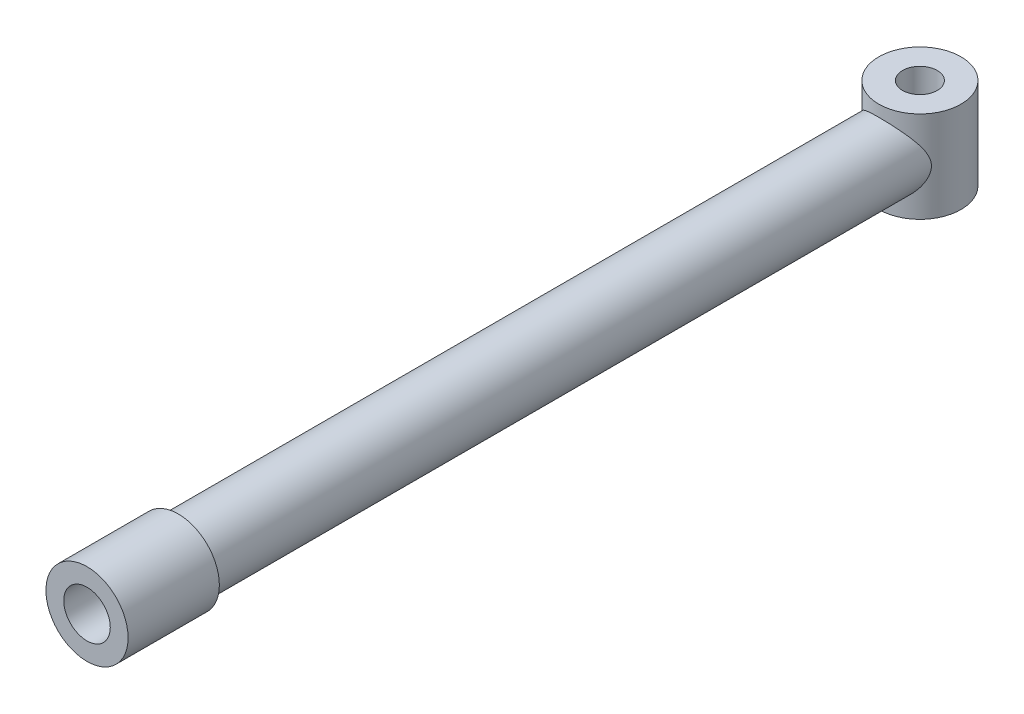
ISO-10303-21;
HEADER;
FILE_DESCRIPTION(('STEP AP214'),'2;1');
FILE_NAME('part.step','',(''),(''),'','','');
FILE_SCHEMA(('AUTOMOTIVE_DESIGN { 1 0 10303 214 1 1 1 1 }'));
ENDSEC;
DATA;
#1=APPLICATION_CONTEXT('core data for automotive mechanical design processes');
#2=APPLICATION_PROTOCOL_DEFINITION('international standard','automotive_design',2000,#1);
#3=PRODUCT_CONTEXT('',#1,'mechanical');
#4=PRODUCT('Part','Part','',(#3));
#5=PRODUCT_RELATED_PRODUCT_CATEGORY('part','',(#4));
#6=PRODUCT_DEFINITION_FORMATION('','',#4);
#7=PRODUCT_DEFINITION_CONTEXT('part definition',#1,'design');
#8=PRODUCT_DEFINITION('design','',#6,#7);
#9=PRODUCT_DEFINITION_SHAPE('','',#8);
#10=(LENGTH_UNIT() NAMED_UNIT(*) SI_UNIT(.MILLI.,.METRE.));
#11=(NAMED_UNIT(*) PLANE_ANGLE_UNIT() SI_UNIT($,.RADIAN.));
#12=(NAMED_UNIT(*) SI_UNIT($,.STERADIAN.) SOLID_ANGLE_UNIT());
#13=UNCERTAINTY_MEASURE_WITH_UNIT(LENGTH_MEASURE(1.E-05),#10,'distance_accuracy_value','');
#14=(GEOMETRIC_REPRESENTATION_CONTEXT(3) GLOBAL_UNCERTAINTY_ASSIGNED_CONTEXT((#13)) GLOBAL_UNIT_ASSIGNED_CONTEXT((#10,
#11,#12)) REPRESENTATION_CONTEXT('',''));
#15=CARTESIAN_POINT('',(0.,0.,0.));
#16=DIRECTION('',(0.,0.,1.));
#17=DIRECTION('',(1.,0.,0.));
#18=AXIS2_PLACEMENT_3D('',#15,#16,#17);
#19=CARTESIAN_POINT('',(0.,0.,912.5));
#20=DIRECTION('',(0.,0.,-1.));
#21=DIRECTION('',(-1.,0.,0.));
#22=AXIS2_PLACEMENT_3D('',#19,#20,#21);
#23=CYLINDRICAL_SURFACE('',#22,75.);
#24=CARTESIAN_POINT('',(0.,0.,712.5));
#25=DIRECTION('',(0.,0.,1.));
#26=DIRECTION('',(1.,0.,0.));
#27=AXIS2_PLACEMENT_3D('',#24,#25,#26);
#28=CIRCLE('',#27,75.);
#29=CARTESIAN_POINT('',(75.,0.,712.5));
#30=VERTEX_POINT('',#29);
#31=EDGE_CURVE('E42',#30,#30,#28,.T.);
#32=ORIENTED_EDGE('',*,*,#31,.F.);
#33=EDGE_LOOP('',(#32));
#34=FACE_BOUND('',#33,.T.);
#35=CARTESIAN_POINT('',(-75.,0.,-862.750628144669));
#36=CARTESIAN_POINT('',(-75.0000002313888,0.662755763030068,-862.750628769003));
#37=CARTESIAN_POINT('',(-74.9912098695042,1.32550517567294,-862.737368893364));
#38=CARTESIAN_POINT('',(-74.9561105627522,2.64955396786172,-862.684515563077));
#39=CARTESIAN_POINT('',(-74.9297997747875,3.31085318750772,-862.644919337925));
#40=CARTESIAN_POINT('',(-74.8598188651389,4.63081840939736,-862.539900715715));
#41=CARTESIAN_POINT('',(-74.8161398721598,5.28948289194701,-862.474465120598));
#42=CARTESIAN_POINT('',(-74.7117178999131,6.60252073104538,-862.318650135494));
#43=CARTESIAN_POINT('',(-74.6509728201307,7.25689354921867,-862.22826767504));
#44=CARTESIAN_POINT('',(-74.4432948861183,9.21525293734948,-861.920774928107));
#45=CARTESIAN_POINT('',(-74.271099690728,10.511125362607,-861.667595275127));
#46=CARTESIAN_POINT('',(-73.8633052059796,13.0727268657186,-861.076851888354));
#47=CARTESIAN_POINT('',(-73.6277054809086,14.3384557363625,-860.739287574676));
#48=CARTESIAN_POINT('',(-72.9941917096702,17.32009455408,-859.847828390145));
#49=CARTESIAN_POINT('',(-72.5687618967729,19.0202812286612,-859.260802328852));
#50=CARTESIAN_POINT('',(-71.613278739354,22.3504712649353,-857.982345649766));
#51=CARTESIAN_POINT('',(-71.0831715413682,23.9804379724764,-857.290861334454));
#52=CARTESIAN_POINT('',(-69.9245603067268,27.1744208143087,-855.830545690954));
#53=CARTESIAN_POINT('',(-69.2958020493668,28.7382529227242,-855.061516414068));
#54=CARTESIAN_POINT('',(-67.9462732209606,31.7977923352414,-853.471265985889));
#55=CARTESIAN_POINT('',(-67.2255069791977,33.2935028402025,-852.650047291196));
#56=CARTESIAN_POINT('',(-65.907518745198,35.8137136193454,-851.206667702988));
#57=CARTESIAN_POINT('',(-65.3314207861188,36.8539201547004,-850.592418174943));
#58=CARTESIAN_POINT('',(-64.1336702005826,38.9008830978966,-849.352433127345));
#59=CARTESIAN_POINT('',(-63.5120139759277,39.9076368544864,-848.726696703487));
#60=CARTESIAN_POINT('',(-62.223484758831,41.8883554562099,-847.468860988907));
#61=CARTESIAN_POINT('',(-61.5565942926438,42.8623074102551,-846.836759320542));
#62=CARTESIAN_POINT('',(-60.1781199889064,44.7770635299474,-845.571161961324));
#63=CARTESIAN_POINT('',(-59.4665373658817,45.7178685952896,-844.937666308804));
#64=CARTESIAN_POINT('',(-57.9994684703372,47.565235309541,-843.674146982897));
#65=CARTESIAN_POINT('',(-57.2440226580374,48.4718272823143,-843.044120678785));
#66=CARTESIAN_POINT('',(-55.6886730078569,50.2510487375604,-841.790954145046));
#67=CARTESIAN_POINT('',(-54.888768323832,51.1236775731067,-841.167814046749));
#68=CARTESIAN_POINT('',(-53.2448214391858,52.8336538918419,-839.932475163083));
#69=CARTESIAN_POINT('',(-52.4007965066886,53.6710149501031,-839.320272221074));
#70=CARTESIAN_POINT('',(-50.668372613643,55.309471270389,-838.110264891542));
#71=CARTESIAN_POINT('',(-49.7799717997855,56.1105650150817,-837.512461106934));
#72=CARTESIAN_POINT('',(-47.4347496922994,58.1250468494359,-835.995999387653));
#73=CARTESIAN_POINT('',(-45.944980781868,59.3104554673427,-835.090633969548));
#74=CARTESIAN_POINT('',(-42.8567108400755,61.5789963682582,-833.33906372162));
#75=CARTESIAN_POINT('',(-41.2582140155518,62.6621326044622,-832.492856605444));
#76=CARTESIAN_POINT('',(-37.9572119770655,64.7149308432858,-830.875103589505));
#77=CARTESIAN_POINT('',(-36.2548462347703,65.6847401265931,-830.103461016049));
#78=CARTESIAN_POINT('',(-32.7493973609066,67.5008986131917,-828.648488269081));
#79=CARTESIAN_POINT('',(-30.9463325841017,68.3472702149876,-827.965142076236));
#80=CARTESIAN_POINT('',(-27.5674993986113,69.7695335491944,-826.810755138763));
#81=CARTESIAN_POINT('',(-26.0063058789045,70.3668909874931,-826.323433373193));
#82=CARTESIAN_POINT('',(-22.8272319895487,71.4614756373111,-825.427365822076));
#83=CARTESIAN_POINT('',(-21.2093576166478,71.9587134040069,-825.018611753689));
#84=CARTESIAN_POINT('',(-17.9260384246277,72.8460543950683,-824.287276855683));
#85=CARTESIAN_POINT('',(-16.2606126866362,73.2361999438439,-823.964661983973));
#86=CARTESIAN_POINT('',(-12.8920704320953,73.9036011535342,-823.411800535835));
#87=CARTESIAN_POINT('',(-11.1889534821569,74.1808555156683,-823.181555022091));
#88=CARTESIAN_POINT('',(-7.750071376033,74.618719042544,-822.817569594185));
#89=CARTESIAN_POINT('',(-6.01419839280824,74.7788285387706,-822.684243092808));
#90=CARTESIAN_POINT('',(-2.53066645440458,74.9775913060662,-822.518689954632));
#91=CARTESIAN_POINT('',(-0.783007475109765,75.0162443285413,-822.486463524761));
#92=CARTESIAN_POINT('',(2.7096061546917,74.9713825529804,-822.523847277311));
#93=CARTESIAN_POINT('',(4.45456084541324,74.887869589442,-822.593455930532));
#94=CARTESIAN_POINT('',(7.92747059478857,74.600207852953,-822.832923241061));
#95=CARTESIAN_POINT('',(9.65542623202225,74.3960632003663,-823.002778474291));
#96=CARTESIAN_POINT('',(12.965641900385,73.8884631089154,-823.424265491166));
#97=CARTESIAN_POINT('',(14.5498825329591,73.5926134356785,-823.669626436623));
#98=CARTESIAN_POINT('',(17.6822816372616,72.9034192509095,-824.239753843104));
#99=CARTESIAN_POINT('',(19.2304421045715,72.5100801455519,-824.564515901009));
#100=CARTESIAN_POINT('',(22.282567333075,71.6310661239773,-825.287917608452));
#101=CARTESIAN_POINT('',(23.786530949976,71.1453888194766,-825.686559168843));
#102=CARTESIAN_POINT('',(26.7436312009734,70.0874073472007,-826.551457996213));
#103=CARTESIAN_POINT('',(28.1967646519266,69.5150977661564,-827.017719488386));
#104=CARTESIAN_POINT('',(31.168876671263,68.2373549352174,-828.053656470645));
#105=CARTESIAN_POINT('',(32.6828623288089,67.5247233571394,-828.628765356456));
#106=CARTESIAN_POINT('',(35.6399454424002,66.0117658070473,-829.841976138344));
#107=CARTESIAN_POINT('',(37.0830407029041,65.211437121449,-830.480079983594));
#108=CARTESIAN_POINT('',(39.8960987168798,63.5294347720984,-831.810940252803));
#109=CARTESIAN_POINT('',(41.2660092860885,62.6477042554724,-832.503734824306));
#110=CARTESIAN_POINT('',(43.9298262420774,60.8094527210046,-833.935016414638));
#111=CARTESIAN_POINT('',(45.2237243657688,59.8529235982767,-834.673508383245));
#112=CARTESIAN_POINT('',(47.4052991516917,58.130293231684,-835.989162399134));
#113=CARTESIAN_POINT('',(48.3106009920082,57.3799444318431,-836.557911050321));
#114=CARTESIAN_POINT('',(50.0789578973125,55.8432630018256,-837.71221566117));
#115=CARTESIAN_POINT('',(50.9420135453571,55.0569308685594,-838.297771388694));
#116=CARTESIAN_POINT('',(52.6261470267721,53.449456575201,-839.48254203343));
#117=CARTESIAN_POINT('',(53.4472058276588,52.6282989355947,-840.08176296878));
#118=CARTESIAN_POINT('',(55.0469014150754,50.9527258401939,-841.290145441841));
#119=CARTESIAN_POINT('',(55.8255392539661,50.0983112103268,-841.899306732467));
#120=CARTESIAN_POINT('',(57.34162582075,48.3557021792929,-843.125006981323));
#121=CARTESIAN_POINT('',(58.0790063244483,47.467455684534,-843.741556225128));
#122=CARTESIAN_POINT('',(59.5111965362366,45.6590399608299,-844.977321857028));
#123=CARTESIAN_POINT('',(60.2060052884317,44.7388700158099,-845.596538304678));
#124=CARTESIAN_POINT('',(61.5526804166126,42.8671940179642,-846.833395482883));
#125=CARTESIAN_POINT('',(62.204561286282,41.915698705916,-847.451036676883));
#126=CARTESIAN_POINT('',(63.4653012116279,39.9811001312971,-848.680481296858));
#127=CARTESIAN_POINT('',(64.0741627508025,38.9979986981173,-849.29228505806));
#128=CARTESIAN_POINT('',(65.5231699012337,36.5323002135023,-850.788995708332));
#129=CARTESIAN_POINT('',(66.3382867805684,35.0311556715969,-851.667790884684));
#130=CARTESIAN_POINT('',(67.8724697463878,31.9574465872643,-853.38441700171));
#131=CARTESIAN_POINT('',(68.5915298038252,30.3848775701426,-854.222245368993));
#132=CARTESIAN_POINT('',(69.5937590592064,27.9725564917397,-855.430021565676));
#133=CARTESIAN_POINT('',(69.9148030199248,27.1604439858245,-855.824053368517));
#134=CARTESIAN_POINT('',(70.5310362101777,25.5175043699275,-856.592794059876));
#135=CARTESIAN_POINT('',(70.8262247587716,24.68667676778,-856.967502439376));
#136=CARTESIAN_POINT('',(71.6714191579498,22.1663351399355,-858.056907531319));
#137=CARTESIAN_POINT('',(72.1815114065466,20.4478674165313,-858.737442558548));
#138=CARTESIAN_POINT('',(72.9378802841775,17.5088309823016,-859.771135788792));
#139=CARTESIAN_POINT('',(73.2159663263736,16.3084332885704,-860.158721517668));
#140=CARTESIAN_POINT('',(73.715686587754,13.8758237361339,-860.864889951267));
#141=CARTESIAN_POINT('',(73.9373282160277,12.6436160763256,-861.183481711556));
#142=CARTESIAN_POINT('',(74.3200817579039,10.1541995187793,-861.739388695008));
#143=CARTESIAN_POINT('',(74.4813143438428,8.89704580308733,-861.976865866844));
#144=CARTESIAN_POINT('',(74.7405052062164,6.36233066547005,-862.361082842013));
#145=CARTESIAN_POINT('',(74.8384655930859,5.08476992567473,-862.507825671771));
#146=CARTESIAN_POINT('',(74.9691795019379,2.50927736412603,-862.704051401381));
#147=CARTESIAN_POINT('',(75.0014483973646,1.21126483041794,-862.752811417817));
#148=CARTESIAN_POINT('',(74.9984516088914,-1.38446445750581,-862.748294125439));
#149=CARTESIAN_POINT('',(74.9631875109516,-2.6821812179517,-862.695019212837));
#150=CARTESIAN_POINT('',(74.8260021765,-5.26757699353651,-862.489157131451));
#151=CARTESIAN_POINT('',(74.7240028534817,-6.5552424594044,-862.336453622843));
#152=CARTESIAN_POINT('',(74.4558096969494,-9.10947993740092,-861.939251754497));
#153=CARTESIAN_POINT('',(74.2896053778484,-10.3760484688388,-861.694738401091));
#154=CARTESIAN_POINT('',(73.8468740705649,-13.1969333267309,-861.052677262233));
#155=CARTESIAN_POINT('',(73.5530971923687,-14.7432874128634,-860.632088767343));
#156=CARTESIAN_POINT('',(72.8776725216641,-17.7840807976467,-859.687303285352));
#157=CARTESIAN_POINT('',(72.4959955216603,-19.2785026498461,-859.163071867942));
#158=CARTESIAN_POINT('',(71.6503437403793,-22.2164717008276,-858.032323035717));
#159=CARTESIAN_POINT('',(71.1861465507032,-23.6598684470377,-857.425584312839));
#160=CARTESIAN_POINT('',(70.181488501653,-26.491819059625,-856.1509362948));
#161=CARTESIAN_POINT('',(69.6410248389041,-27.8803709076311,-855.483024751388));
#162=CARTESIAN_POINT('',(68.6119550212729,-30.3108234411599,-854.251409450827));
#163=CARTESIAN_POINT('',(68.1372302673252,-31.3630019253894,-853.696223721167));
#164=CARTESIAN_POINT('',(67.1445159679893,-33.435525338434,-852.565201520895));
#165=CARTESIAN_POINT('',(66.6265215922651,-34.4558666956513,-851.989362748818));
#166=CARTESIAN_POINT('',(65.5480719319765,-36.4657578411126,-850.82276212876));
#167=CARTESIAN_POINT('',(64.9875982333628,-37.4552940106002,-850.231993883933));
#168=CARTESIAN_POINT('',(63.8250665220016,-39.4036508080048,-849.040931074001));
#169=CARTESIAN_POINT('',(63.2230098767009,-40.3624724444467,-848.440636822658));
#170=CARTESIAN_POINT('',(61.9769845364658,-42.2508521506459,-847.234340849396));
#171=CARTESIAN_POINT('',(61.3329672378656,-43.1803743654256,-846.628333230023));
#172=CARTESIAN_POINT('',(60.0038958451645,-45.008999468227,-845.41541209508));
#173=CARTESIAN_POINT('',(59.3188415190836,-45.9081021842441,-844.808498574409));
#174=CARTESIAN_POINT('',(57.9079479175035,-47.6754425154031,-843.59765149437));
#175=CARTESIAN_POINT('',(57.182116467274,-48.5436860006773,-842.993717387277));
#176=CARTESIAN_POINT('',(55.6895842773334,-50.2489208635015,-841.792234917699));
#177=CARTESIAN_POINT('',(54.9228834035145,-51.085912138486,-841.194686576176));
#178=CARTESIAN_POINT('',(53.3283948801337,-52.7488681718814,-839.994112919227));
#179=CARTESIAN_POINT('',(52.4995440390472,-53.5739975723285,-839.391341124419));
#180=CARTESIAN_POINT('',(50.7988905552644,-55.1892012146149,-838.199590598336));
#181=CARTESIAN_POINT('',(49.9270887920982,-55.9792761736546,-837.610611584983));
#182=CARTESIAN_POINT('',(48.1404090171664,-57.5229963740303,-836.449778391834));
#183=CARTESIAN_POINT('',(47.2255214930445,-58.2766334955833,-835.87792803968));
#184=CARTESIAN_POINT('',(45.3530577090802,-59.7454266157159,-834.754955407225));
#185=CARTESIAN_POINT('',(44.395480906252,-60.4605821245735,-834.20383339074));
#186=CARTESIAN_POINT('',(42.4407828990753,-61.8483026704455,-833.127326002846));
#187=CARTESIAN_POINT('',(41.4437790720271,-62.5209806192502,-832.601873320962));
#188=CARTESIAN_POINT('',(39.4084702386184,-63.8234445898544,-831.578619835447));
#189=CARTESIAN_POINT('',(38.370167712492,-64.453233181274,-831.080817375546));
#190=CARTESIAN_POINT('',(36.2538470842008,-65.6669282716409,-830.11669052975));
#191=CARTESIAN_POINT('',(35.1758541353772,-66.2508631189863,-829.650346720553));
#192=CARTESIAN_POINT('',(32.9807513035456,-67.3705316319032,-828.752302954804));
#193=CARTESIAN_POINT('',(31.863632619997,-67.9062543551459,-828.320610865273));
#194=CARTESIAN_POINT('',(29.2119852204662,-69.0971848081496,-827.357411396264));
#195=CARTESIAN_POINT('',(27.6629135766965,-69.7323558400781,-826.840867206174));
#196=CARTESIAN_POINT('',(24.5049635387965,-70.9037440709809,-825.884605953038));
#197=CARTESIAN_POINT('',(22.8961016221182,-71.439988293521,-825.444867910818));
#198=CARTESIAN_POINT('',(20.4445772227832,-72.1647141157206,-824.848831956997));
#199=CARTESIAN_POINT('',(19.6211202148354,-72.3929959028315,-824.66076513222));
#200=CARTESIAN_POINT('',(17.9625271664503,-72.8222562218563,-824.306654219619));
#201=CARTESIAN_POINT('',(17.1273930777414,-73.0232392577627,-824.140606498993));
#202=CARTESIAN_POINT('',(15.4465926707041,-73.3971672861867,-823.831329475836));
#203=CARTESIAN_POINT('',(14.6009252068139,-73.5701091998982,-823.688102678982));
#204=CARTESIAN_POINT('',(12.9005326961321,-73.8872399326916,-823.425220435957));
#205=CARTESIAN_POINT('',(12.0458072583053,-74.0314275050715,-823.305566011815));
#206=CARTESIAN_POINT('',(10.3247094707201,-74.2910589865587,-823.089954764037));
#207=CARTESIAN_POINT('',(9.45830069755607,-74.4063597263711,-822.994115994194));
#208=CARTESIAN_POINT('',(7.71960521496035,-74.606792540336,-822.827426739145));
#209=CARTESIAN_POINT('',(6.84731851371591,-74.691924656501,-822.756576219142));
#210=CARTESIAN_POINT('',(5.09860817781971,-74.8316348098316,-822.640264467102));
#211=CARTESIAN_POINT('',(4.22218452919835,-74.8862127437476,-822.594803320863));
#212=CARTESIAN_POINT('',(2.46700453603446,-74.9645621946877,-822.529531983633));
#213=CARTESIAN_POINT('',(1.58824818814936,-74.9883336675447,-822.509721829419));
#214=CARTESIAN_POINT('',(-0.16972177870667,-75.0049587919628,-822.495867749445));
#215=CARTESIAN_POINT('',(-1.04893537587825,-74.9978138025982,-822.501822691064));
#216=CARTESIAN_POINT('',(-2.80601575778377,-74.9526425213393,-822.539461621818));
#217=CARTESIAN_POINT('',(-3.68388254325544,-74.9146162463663,-822.571145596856));
#218=CARTESIAN_POINT('',(-5.43641209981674,-74.8078611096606,-822.660057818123));
#219=CARTESIAN_POINT('',(-6.31107499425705,-74.7391334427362,-822.717285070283));
#220=CARTESIAN_POINT('',(-8.05544180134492,-74.571292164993,-822.856955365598));
#221=CARTESIAN_POINT('',(-8.92514578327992,-74.4721789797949,-822.939398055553));
#222=CARTESIAN_POINT('',(-10.5946246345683,-74.2523403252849,-823.122113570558));
#223=CARTESIAN_POINT('',(-11.3948682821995,-74.133721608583,-823.220644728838));
#224=CARTESIAN_POINT('',(-12.9883678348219,-73.8712032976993,-823.438508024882));
#225=CARTESIAN_POINT('',(-13.7816231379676,-73.7273015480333,-823.557841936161));
#226=CARTESIAN_POINT('',(-16.1487896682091,-73.2584638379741,-823.94622216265));
#227=CARTESIAN_POINT('',(-17.7106055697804,-72.8963286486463,-824.245702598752));
#228=CARTESIAN_POINT('',(-20.79235066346,-72.0778840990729,-824.920505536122));
#229=CARTESIAN_POINT('',(-22.3122779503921,-71.6215704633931,-825.295831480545));
#230=CARTESIAN_POINT('',(-25.3033208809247,-70.6203176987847,-826.116280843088));
#231=CARTESIAN_POINT('',(-26.7744335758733,-70.07537322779,-826.561408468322));
#232=CARTESIAN_POINT('',(-29.7666659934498,-68.8602839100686,-827.549398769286));
#233=CARTESIAN_POINT('',(-31.2836923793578,-68.1839302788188,-828.097004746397));
#234=CARTESIAN_POINT('',(-34.2497704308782,-66.7433288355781,-829.256446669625));
#235=CARTESIAN_POINT('',(-35.6988206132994,-65.9790791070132,-829.868284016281));
#236=CARTESIAN_POINT('',(-38.5261881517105,-64.3691010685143,-831.148033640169));
#237=CARTESIAN_POINT('',(-39.9044642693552,-63.5233260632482,-831.815978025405));
#238=CARTESIAN_POINT('',(-42.5873285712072,-61.7567765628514,-833.199322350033));
#239=CARTESIAN_POINT('',(-43.891908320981,-60.8359935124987,-833.914727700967));
#240=CARTESIAN_POINT('',(-46.0944027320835,-59.1749890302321,-835.192327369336));
#241=CARTESIAN_POINT('',(-47.0094465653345,-58.450519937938,-835.745662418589));
#242=CARTESIAN_POINT('',(-48.7983027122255,-56.9655758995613,-836.870364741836));
#243=CARTESIAN_POINT('',(-49.6721155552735,-56.2051014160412,-837.441731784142));
#244=CARTESIAN_POINT('',(-51.3787213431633,-54.6494355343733,-838.599453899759));
#245=CARTESIAN_POINT('',(-52.2114963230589,-53.8542292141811,-839.185815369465));
#246=CARTESIAN_POINT('',(-53.8355683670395,-52.2307370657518,-840.36996827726));
#247=CARTESIAN_POINT('',(-54.6268664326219,-51.4024520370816,-840.967759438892));
#248=CARTESIAN_POINT('',(-56.1694690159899,-49.7121960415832,-842.172549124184));
#249=CARTESIAN_POINT('',(-56.920694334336,-48.8501638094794,-842.779563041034));
#250=CARTESIAN_POINT('',(-58.3815213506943,-47.0946070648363,-843.998155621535));
#251=CARTESIAN_POINT('',(-59.0911222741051,-46.2010819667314,-844.609734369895));
#252=CARTESIAN_POINT('',(-60.4684019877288,-44.3832442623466,-845.833511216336));
#253=CARTESIAN_POINT('',(-61.1360931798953,-43.458940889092,-846.445709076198));
#254=CARTESIAN_POINT('',(-62.4295818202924,-41.5794266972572,-847.666843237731));
#255=CARTESIAN_POINT('',(-63.0553811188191,-40.6242172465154,-848.275779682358));
#256=CARTESIAN_POINT('',(-64.1333251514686,-38.8936727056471,-849.354414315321));
#257=CARTESIAN_POINT('',(-64.5936542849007,-38.1243574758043,-849.825614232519));
#258=CARTESIAN_POINT('',(-65.4882159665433,-36.5663851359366,-850.760933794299));
#259=CARTESIAN_POINT('',(-65.9224469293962,-35.7777268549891,-851.225053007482));
#260=CARTESIAN_POINT('',(-66.764474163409,-34.1806963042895,-852.143614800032));
#261=CARTESIAN_POINT('',(-67.1722664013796,-33.3723210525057,-852.598055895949));
#262=CARTESIAN_POINT('',(-67.9608162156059,-31.7356660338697,-853.494206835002));
#263=CARTESIAN_POINT('',(-68.3415763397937,-30.907388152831,-853.935917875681));
#264=CARTESIAN_POINT('',(-69.0746891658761,-29.2321992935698,-854.802437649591));
#265=CARTESIAN_POINT('',(-69.4270999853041,-28.3853312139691,-855.227280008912));
#266=CARTESIAN_POINT('',(-70.1036014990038,-26.6708523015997,-856.057358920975));
#267=CARTESIAN_POINT('',(-70.4276913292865,-25.8032408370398,-856.462594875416));
#268=CARTESIAN_POINT('',(-71.0463903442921,-24.0473781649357,-857.249111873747));
#269=CARTESIAN_POINT('',(-71.341013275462,-23.159136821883,-857.630404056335));
#270=CARTESIAN_POINT('',(-71.8996909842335,-21.3616520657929,-858.364547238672));
#271=CARTESIAN_POINT('',(-72.1637493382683,-20.4524111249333,-858.717401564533));
#272=CARTESIAN_POINT('',(-72.7394137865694,-18.31827650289,-859.497341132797));
#273=CARTESIAN_POINT('',(-73.0391631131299,-17.0855514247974,-859.912007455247));
#274=CARTESIAN_POINT('',(-73.5792024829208,-14.5854900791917,-860.67029830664));
#275=CARTESIAN_POINT('',(-73.8194906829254,-13.3181527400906,-861.013920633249));
#276=CARTESIAN_POINT('',(-74.2358574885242,-10.7570192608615,-861.616094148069));
#277=CARTESIAN_POINT('',(-74.4121425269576,-9.46332265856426,-861.874918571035));
#278=CARTESIAN_POINT('',(-74.6263047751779,-7.50638055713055,-862.191646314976));
#279=CARTESIAN_POINT('',(-74.6893076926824,-6.85145524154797,-862.285293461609));
#280=CARTESIAN_POINT('',(-74.7982266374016,-5.53713144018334,-862.447677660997));
#281=CARTESIAN_POINT('',(-74.8441445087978,-4.87773344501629,-862.516417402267));
#282=CARTESIAN_POINT('',(-74.920803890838,-3.51641856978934,-862.631390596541));
#283=CARTESIAN_POINT('',(-74.9504792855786,-2.8143072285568,-862.676040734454));
#284=CARTESIAN_POINT('',(-74.9900790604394,-1.40812842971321,-862.735661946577));
#285=CARTESIAN_POINT('',(-74.9999997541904,-0.704060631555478,-862.750627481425));
#286=CARTESIAN_POINT('',(-75.,0.,-862.750628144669));
#287=B_SPLINE_CURVE_WITH_KNOTS('',3,(#35,#36,#37,#38,#39,#40,#41,#42,#43,#44,#45,#46,#47,#48,
#49,#50,#51,#52,#53,#54,#55,#56,#57,#58,#59,#60,#61,#62,#63,#64,#65,#66,#67,#68,#69,#70,#71,#72,
#73,#74,#75,#76,#77,#78,#79,#80,#81,#82,#83,#84,#85,#86,#87,#88,#89,#90,#91,#92,#93,#94,#95,#96,
#97,#98,#99,#100,#101,#102,#103,#104,#105,#106,#107,#108,#109,#110,#111,#112,#113,#114,#115,
#116,#117,#118,#119,#120,#121,#122,#123,#124,#125,#126,#127,#128,#129,#130,#131,#132,#133,#134,
#135,#136,#137,#138,#139,#140,#141,#142,#143,#144,#145,#146,#147,#148,#149,#150,#151,#152,#153,
#154,#155,#156,#157,#158,#159,#160,#161,#162,#163,#164,#165,#166,#167,#168,#169,#170,#171,#172,
#173,#174,#175,#176,#177,#178,#179,#180,#181,#182,#183,#184,#185,#186,#187,#188,#189,#190,#191,
#192,#193,#194,#195,#196,#197,#198,#199,#200,#201,#202,#203,#204,#205,#206,#207,#208,#209,#210,
#211,#212,#213,#214,#215,#216,#217,#218,#219,#220,#221,#222,#223,#224,#225,#226,#227,#228,#229,
#230,#231,#232,#233,#234,#235,#236,#237,#238,#239,#240,#241,#242,#243,#244,#245,#246,#247,#248,
#249,#250,#251,#252,#253,#254,#255,#256,#257,#258,#259,#260,#261,#262,#263,#264,#265,#266,#267,
#268,#269,#270,#271,#272,#273,#274,#275,#276,#277,#278,#279,#280,#281,#282,#283,#284,#285,#286),
.UNSPECIFIED.,.T.,.F.,(4,2,2,2,2,2,2,2,2,2,2,2,2,2,2,2,2,2,2,2,2,2,2,2,2,2,2,2,2,2,2,2,2,2,2,2,
2,2,2,2,2,2,2,2,2,2,2,2,2,2,2,2,2,2,2,2,2,2,2,2,2,2,2,2,2,2,2,2,2,2,2,2,2,2,2,2,2,2,2,2,2,2,2,2,
2,2,2,2,2,2,2,2,2,2,2,2,2,2,2,2,2,2,2,2,2,2,2,2,2,2,2,2,2,2,2,2,2,2,2,2,2,2,2,2,2,4),(0.,
1.98806538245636,3.97633993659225,5.96563136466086,7.95516774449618,11.9443168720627,
15.9334934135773,21.4693122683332,27.007986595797,32.5611757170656,38.1141036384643,
42.128022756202,46.1422592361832,50.1580553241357,54.173742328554,58.1857822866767,
62.197898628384,66.2084562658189,70.2191815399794,76.5375473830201,82.8556688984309,
89.1654857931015,95.4741563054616,100.692489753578,105.910272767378,111.125990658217,
116.34176855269,121.579666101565,126.817574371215,132.055403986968,137.293054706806,
142.178314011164,147.063302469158,151.948417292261,156.833837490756,162.136958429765,
167.440243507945,172.747260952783,178.054854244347,181.972121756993,185.889335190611,
189.808308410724,193.727184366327,197.652359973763,201.577623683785,205.501555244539,
209.42526009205,215.184266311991,220.943633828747,223.817117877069,226.690677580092,
232.43387324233,236.306132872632,240.177883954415,244.04185910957,247.905705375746,
251.797954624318,255.690112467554,259.586832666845,263.484189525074,268.364152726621,
273.245739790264,278.140688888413,283.035817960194,286.877198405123,290.719008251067,
294.562493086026,298.405851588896,302.253743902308,306.101657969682,309.948836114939,
313.796026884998,317.742030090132,321.687952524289,325.634750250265,329.581598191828,
333.517470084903,337.453105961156,341.386289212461,345.320362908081,350.571409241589,
355.821019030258,358.445265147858,361.06907776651,363.693178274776,366.317392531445,
368.954366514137,371.59133682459,374.228316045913,376.865299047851,379.502166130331,
382.139031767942,384.775794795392,387.412520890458,389.856701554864,392.301090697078,
397.188339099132,402.075809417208,406.963574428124,412.205292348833,417.447124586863,
422.691977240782,427.937428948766,431.811125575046,435.684772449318,439.560100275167,
443.435334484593,447.317963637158,451.200665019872,455.08221196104,458.963587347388,
462.001502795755,465.039602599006,468.078164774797,471.116440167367,474.148319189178,
477.180290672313,480.210841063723,483.24103648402,487.241704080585,491.242495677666,
495.230266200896,497.223420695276,499.216359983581,501.327933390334,503.439900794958),.UNSPECIFIED.);
#288=CARTESIAN_POINT('',(-75.,0.,-862.750628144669));
#289=VERTEX_POINT('',#288);
#290=EDGE_CURVE('E10',#289,#289,#287,.T.);
#291=ORIENTED_EDGE('',*,*,#290,.F.);
#292=EDGE_LOOP('',(#291));
#293=FACE_BOUND('',#292,.T.);
#294=ADVANCED_FACE('F31',(#34,#293),#23,.T.);
#295=CARTESIAN_POINT('',(0.,0.,712.5));
#296=DIRECTION('',(0.,0.,1.));
#297=DIRECTION('',(1.,0.,0.));
#298=AXIS2_PLACEMENT_3D('',#295,#296,#297);
#299=CYLINDRICAL_SURFACE('',#298,90.);
#300=CARTESIAN_POINT('',(0.,0.,712.5));
#301=DIRECTION('',(0.,0.,1.));
#302=DIRECTION('',(1.,0.,0.));
#303=AXIS2_PLACEMENT_3D('',#300,#301,#302);
#304=CIRCLE('',#303,90.);
#305=CARTESIAN_POINT('',(90.,0.,712.5));
#306=VERTEX_POINT('',#305);
#307=EDGE_CURVE('E46',#306,#306,#304,.T.);
#308=ORIENTED_EDGE('',*,*,#307,.T.);
#309=EDGE_LOOP('',(#308));
#310=FACE_BOUND('',#309,.T.);
#311=CARTESIAN_POINT('',(0.,0.,912.5));
#312=DIRECTION('',(0.,0.,1.));
#313=DIRECTION('',(1.,0.,0.));
#314=AXIS2_PLACEMENT_3D('',#311,#312,#313);
#315=CIRCLE('',#314,90.);
#316=CARTESIAN_POINT('',(90.,0.,912.5));
#317=VERTEX_POINT('',#316);
#318=EDGE_CURVE('E50',#317,#317,#315,.T.);
#319=ORIENTED_EDGE('',*,*,#318,.F.);
#320=EDGE_LOOP('',(#319));
#321=FACE_BOUND('',#320,.T.);
#322=ADVANCED_FACE('F103',(#310,#321),#299,.T.);
#323=CARTESIAN_POINT('',(0.,0.,712.5));
#324=DIRECTION('',(0.,0.,1.));
#325=DIRECTION('',(1.,0.,0.));
#326=AXIS2_PLACEMENT_3D('',#323,#324,#325);
#327=PLANE('',#326);
#328=ORIENTED_EDGE('',*,*,#31,.T.);
#329=EDGE_LOOP('',(#328));
#330=FACE_BOUND('',#329,.T.);
#331=ORIENTED_EDGE('',*,*,#307,.F.);
#332=EDGE_LOOP('',(#331));
#333=FACE_BOUND('',#332,.T.);
#334=ADVANCED_FACE('F97',(#330,#333),#327,.F.);
#335=CARTESIAN_POINT('',(0.,0.,912.5));
#336=DIRECTION('',(0.,0.,1.));
#337=DIRECTION('',(1.,0.,0.));
#338=AXIS2_PLACEMENT_3D('',#335,#336,#337);
#339=PLANE('',#338);
#340=CARTESIAN_POINT('',(0.,0.,912.5));
#341=DIRECTION('',(0.,0.,1.));
#342=DIRECTION('',(1.,0.,0.));
#343=AXIS2_PLACEMENT_3D('',#340,#341,#342);
#344=CIRCLE('',#343,51.);
#345=CARTESIAN_POINT('',(51.,0.,912.5));
#346=VERTEX_POINT('',#345);
#347=EDGE_CURVE('E62',#346,#346,#344,.T.);
#348=ORIENTED_EDGE('',*,*,#347,.F.);
#349=EDGE_LOOP('',(#348));
#350=FACE_BOUND('',#349,.T.);
#351=ORIENTED_EDGE('',*,*,#318,.T.);
#352=EDGE_LOOP('',(#351));
#353=FACE_BOUND('',#352,.T.);
#354=ADVANCED_FACE('F92',(#350,#353),#339,.T.);
#355=CARTESIAN_POINT('',(0.,100.,-912.5));
#356=DIRECTION('',(0.,-1.,0.));
#357=DIRECTION('',(0.,0.,-1.));
#358=AXIS2_PLACEMENT_3D('',#355,#356,#357);
#359=CYLINDRICAL_SURFACE('',#358,90.);
#360=CARTESIAN_POINT('',(0.,-100.,-912.5));
#361=DIRECTION('',(0.,1.,0.));
#362=DIRECTION('',(0.,0.,1.));
#363=AXIS2_PLACEMENT_3D('',#360,#361,#362);
#364=CIRCLE('',#363,90.);
#365=CARTESIAN_POINT('',(0.,-100.,-822.5));
#366=VERTEX_POINT('',#365);
#367=EDGE_CURVE('E56',#366,#366,#364,.T.);
#368=ORIENTED_EDGE('',*,*,#367,.T.);
#369=EDGE_LOOP('',(#368));
#370=FACE_BOUND('',#369,.T.);
#371=CARTESIAN_POINT('',(0.,100.,-912.5));
#372=DIRECTION('',(0.,1.,0.));
#373=DIRECTION('',(0.,0.,1.));
#374=AXIS2_PLACEMENT_3D('',#371,#372,#373);
#375=CIRCLE('',#374,90.);
#376=CARTESIAN_POINT('',(0.,100.,-822.5));
#377=VERTEX_POINT('',#376);
#378=EDGE_CURVE('E54',#377,#377,#375,.T.);
#379=ORIENTED_EDGE('',*,*,#378,.F.);
#380=EDGE_LOOP('',(#379));
#381=FACE_BOUND('',#380,.T.);
#382=ORIENTED_EDGE('',*,*,#290,.T.);
#383=EDGE_LOOP('',(#382));
#384=FACE_BOUND('',#383,.T.);
#385=ADVANCED_FACE('F87',(#370,#381,#384),#359,.T.);
#386=CARTESIAN_POINT('',(0.,100.,-912.5));
#387=DIRECTION('',(0.,1.,0.));
#388=DIRECTION('',(0.,0.,1.));
#389=AXIS2_PLACEMENT_3D('',#386,#387,#388);
#390=PLANE('',#389);
#391=CARTESIAN_POINT('',(0.,100.,-912.5));
#392=DIRECTION('',(0.,1.,0.));
#393=DIRECTION('',(0.,0.,1.));
#394=AXIS2_PLACEMENT_3D('',#391,#392,#393);
#395=CIRCLE('',#394,38.);
#396=CARTESIAN_POINT('',(0.,100.,-874.5));
#397=VERTEX_POINT('',#396);
#398=EDGE_CURVE('E68',#397,#397,#395,.T.);
#399=ORIENTED_EDGE('',*,*,#398,.F.);
#400=EDGE_LOOP('',(#399));
#401=FACE_BOUND('',#400,.T.);
#402=ORIENTED_EDGE('',*,*,#378,.T.);
#403=EDGE_LOOP('',(#402));
#404=FACE_BOUND('',#403,.T.);
#405=ADVANCED_FACE('F84',(#401,#404),#390,.T.);
#406=CARTESIAN_POINT('',(0.,-100.,-912.5));
#407=DIRECTION('',(0.,1.,0.));
#408=DIRECTION('',(0.,0.,1.));
#409=AXIS2_PLACEMENT_3D('',#406,#407,#408);
#410=PLANE('',#409);
#411=CARTESIAN_POINT('',(0.,-100.,-912.5));
#412=DIRECTION('',(0.,1.,0.));
#413=DIRECTION('',(0.,0.,1.));
#414=AXIS2_PLACEMENT_3D('',#411,#412,#413);
#415=CIRCLE('',#414,38.);
#416=CARTESIAN_POINT('',(0.,-100.,-874.5));
#417=VERTEX_POINT('',#416);
#418=EDGE_CURVE('E65',#417,#417,#415,.T.);
#419=ORIENTED_EDGE('',*,*,#418,.T.);
#420=EDGE_LOOP('',(#419));
#421=FACE_BOUND('',#420,.T.);
#422=ORIENTED_EDGE('',*,*,#367,.F.);
#423=EDGE_LOOP('',(#422));
#424=FACE_BOUND('',#423,.T.);
#425=ADVANCED_FACE('F74',(#421,#424),#410,.F.);
#426=CARTESIAN_POINT('',(0.,0.,-822.5));
#427=DIRECTION('',(0.,0.,1.));
#428=DIRECTION('',(1.,0.,0.));
#429=AXIS2_PLACEMENT_3D('',#426,#427,#428);
#430=CYLINDRICAL_SURFACE('',#429,51.);
#431=CARTESIAN_POINT('',(0.,0.,-822.5));
#432=DIRECTION('',(0.,0.,1.));
#433=DIRECTION('',(1.,0.,0.));
#434=AXIS2_PLACEMENT_3D('',#431,#432,#433);
#435=CIRCLE('',#434,51.);
#436=CARTESIAN_POINT('',(51.,0.,-822.5));
#437=VERTEX_POINT('',#436);
#438=EDGE_CURVE('E59',#437,#437,#435,.T.);
#439=ORIENTED_EDGE('',*,*,#438,.F.);
#440=EDGE_LOOP('',(#439));
#441=FACE_BOUND('',#440,.T.);
#442=ORIENTED_EDGE('',*,*,#347,.T.);
#443=EDGE_LOOP('',(#442));
#444=FACE_BOUND('',#443,.T.);
#445=ADVANCED_FACE('F134',(#441,#444),#430,.F.);
#446=CARTESIAN_POINT('',(0.,0.,-822.5));
#447=DIRECTION('',(0.,0.,1.));
#448=DIRECTION('',(1.,0.,0.));
#449=AXIS2_PLACEMENT_3D('',#446,#447,#448);
#450=PLANE('',#449);
#451=ORIENTED_EDGE('',*,*,#438,.T.);
#452=EDGE_LOOP('',(#451));
#453=FACE_BOUND('',#452,.T.);
#454=ADVANCED_FACE('F80',(#453),#450,.T.);
#455=CARTESIAN_POINT('',(0.,-100.,-912.5));
#456=DIRECTION('',(0.,1.,0.));
#457=DIRECTION('',(0.,0.,1.));
#458=AXIS2_PLACEMENT_3D('',#455,#456,#457);
#459=CYLINDRICAL_SURFACE('',#458,38.);
#460=ORIENTED_EDGE('',*,*,#418,.F.);
#461=EDGE_LOOP('',(#460));
#462=FACE_BOUND('',#461,.T.);
#463=ORIENTED_EDGE('',*,*,#398,.T.);
#464=EDGE_LOOP('',(#463));
#465=FACE_BOUND('',#464,.T.);
#466=ADVANCED_FACE('F77',(#462,#465),#459,.F.);
#467=CLOSED_SHELL('',(#294,#322,#334,#354,#385,#405,#425,#445,#454,#466));
#468=MANIFOLD_SOLID_BREP('B2',#467);
#469=ADVANCED_BREP_SHAPE_REPRESENTATION('',(#18,#468),#14);
#470=SHAPE_DEFINITION_REPRESENTATION(#9,#469);
ENDSEC;
END-ISO-10303-21;
